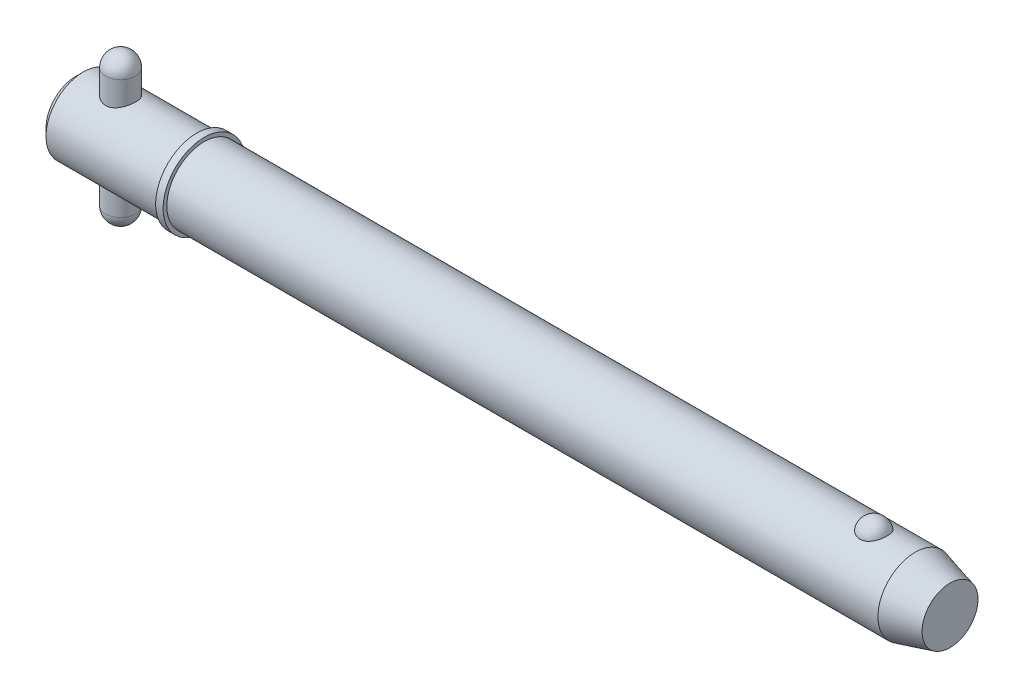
ISO-10303-21;
HEADER;
FILE_DESCRIPTION(('STEP AP214'),'2;1');
FILE_NAME('part.step','',(''),(''),'','','');
FILE_SCHEMA(('AUTOMOTIVE_DESIGN { 1 0 10303 214 1 1 1 1 }'));
ENDSEC;
DATA;
#1=APPLICATION_CONTEXT('core data for automotive mechanical design processes');
#2=APPLICATION_PROTOCOL_DEFINITION('international standard','automotive_design',2000,#1);
#3=PRODUCT_CONTEXT('',#1,'mechanical');
#4=PRODUCT('Part','Part','',(#3));
#5=PRODUCT_RELATED_PRODUCT_CATEGORY('part','',(#4));
#6=PRODUCT_DEFINITION_FORMATION('','',#4);
#7=PRODUCT_DEFINITION_CONTEXT('part definition',#1,'design');
#8=PRODUCT_DEFINITION('design','',#6,#7);
#9=PRODUCT_DEFINITION_SHAPE('','',#8);
#10=(LENGTH_UNIT() NAMED_UNIT(*) SI_UNIT(.MILLI.,.METRE.));
#11=(NAMED_UNIT(*) PLANE_ANGLE_UNIT() SI_UNIT($,.RADIAN.));
#12=(NAMED_UNIT(*) SI_UNIT($,.STERADIAN.) SOLID_ANGLE_UNIT());
#13=UNCERTAINTY_MEASURE_WITH_UNIT(LENGTH_MEASURE(1.E-05),#10,'distance_accuracy_value','');
#14=(GEOMETRIC_REPRESENTATION_CONTEXT(3) GLOBAL_UNCERTAINTY_ASSIGNED_CONTEXT((#13)) GLOBAL_UNIT_ASSIGNED_CONTEXT((#10,
#11,#12)) REPRESENTATION_CONTEXT('',''));
#15=CARTESIAN_POINT('',(0.,0.,0.));
#16=DIRECTION('',(0.,0.,1.));
#17=DIRECTION('',(1.,0.,0.));
#18=AXIS2_PLACEMENT_3D('',#15,#16,#17);
#19=CARTESIAN_POINT('',(9.525,15.875,0.));
#20=DIRECTION('',(0.,-1.,0.));
#21=DIRECTION('',(0.,0.,-1.));
#22=AXIS2_PLACEMENT_3D('',#19,#20,#21);
#23=CYLINDRICAL_SURFACE('',#22,3.175);
#24=CARTESIAN_POINT('',(9.525,-12.7,0.));
#25=DIRECTION('',(0.,-1.,0.));
#26=DIRECTION('',(0.,0.,-1.));
#27=AXIS2_PLACEMENT_3D('',#24,#25,#26);
#28=CIRCLE('',#27,3.175);
#29=CARTESIAN_POINT('',(9.525,-12.7,-3.175));
#30=VERTEX_POINT('',#29);
#31=EDGE_CURVE('P0_E10',#30,#30,#28,.F.);
#32=ORIENTED_EDGE('',*,*,#31,.T.);
#33=EDGE_LOOP('',(#32));
#34=FACE_BOUND('',#33,.T.);
#35=CARTESIAN_POINT('',(9.525,12.7,0.));
#36=DIRECTION('',(0.,-1.,0.));
#37=DIRECTION('',(0.,0.,-1.));
#38=AXIS2_PLACEMENT_3D('',#35,#36,#37);
#39=CIRCLE('',#38,3.175);
#40=CARTESIAN_POINT('',(9.525,12.7,-3.175));
#41=VERTEX_POINT('',#40);
#42=EDGE_CURVE('P0_E21',#41,#41,#39,.T.);
#43=ORIENTED_EDGE('',*,*,#42,.T.);
#44=EDGE_LOOP('',(#43));
#45=FACE_BOUND('',#44,.T.);
#46=ADVANCED_FACE('P0_F14',(#34,#45),#23,.T.);
#47=CARTESIAN_POINT('',(9.525,-12.7,0.));
#48=DIRECTION('',(0.,0.,1.));
#49=DIRECTION('',(1.,0.,0.));
#50=AXIS2_PLACEMENT_3D('',#47,#48,#49);
#51=SPHERICAL_SURFACE('',#50,3.175);
#52=CARTESIAN_POINT('',(9.525,-12.7,0.));
#53=DIRECTION('',(0.,-1.,0.));
#54=DIRECTION('',(0.,0.,-1.));
#55=AXIS2_PLACEMENT_3D('',#52,#53,#54);
#56=SPHERICAL_SURFACE('',#55,3.175);
#57=ORIENTED_EDGE('',*,*,#31,.F.);
#58=EDGE_LOOP('',(#57));
#59=FACE_BOUND('',#58,.T.);
#60=ADVANCED_FACE('P0_F29',(#59),#56,.T.);
#61=CARTESIAN_POINT('',(9.525,12.7,0.));
#62=DIRECTION('',(0.,0.,1.));
#63=DIRECTION('',(1.,0.,0.));
#64=AXIS2_PLACEMENT_3D('',#61,#62,#63);
#65=SPHERICAL_SURFACE('',#64,3.175);
#66=CARTESIAN_POINT('',(9.525,12.7,0.));
#67=DIRECTION('',(0.,-1.,0.));
#68=DIRECTION('',(0.,0.,-1.));
#69=AXIS2_PLACEMENT_3D('',#66,#67,#68);
#70=SPHERICAL_SURFACE('',#69,3.175);
#71=ORIENTED_EDGE('',*,*,#42,.F.);
#72=EDGE_LOOP('',(#71));
#73=FACE_BOUND('',#72,.T.);
#74=ADVANCED_FACE('P0_F16',(#73),#70,.T.);
#75=CLOSED_SHELL('',(#46,#60,#74));
#76=MANIFOLD_SOLID_BREP('P0_B1',#75);
#77=CARTESIAN_POINT('',(0.,0.,0.));
#78=DIRECTION('',(1.,0.,0.));
#79=DIRECTION('',(0.,0.,-1.));
#80=AXIS2_PLACEMENT_3D('',#77,#78,#79);
#81=CYLINDRICAL_SURFACE('',#80,7.94);
#82=CARTESIAN_POINT('',(178.651879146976,0.,0.));
#83=DIRECTION('',(1.,0.,0.));
#84=DIRECTION('',(0.,0.,-1.));
#85=AXIS2_PLACEMENT_3D('',#82,#83,#84);
#86=CIRCLE('',#85,7.94);
#87=CARTESIAN_POINT('',(178.651879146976,0.,-7.94));
#88=VERTEX_POINT('',#87);
#89=EDGE_CURVE('P1_E81',#88,#88,#86,.T.);
#90=ORIENTED_EDGE('',*,*,#89,.F.);
#91=EDGE_LOOP('',(#90));
#92=FACE_BOUND('',#91,.T.);
#93=CARTESIAN_POINT('',(27.31,0.,0.));
#94=DIRECTION('',(1.,0.,0.));
#95=DIRECTION('',(0.,0.,-1.));
#96=AXIS2_PLACEMENT_3D('',#93,#94,#95);
#97=CIRCLE('',#96,7.94);
#98=CARTESIAN_POINT('',(27.31,0.,-7.94));
#99=VERTEX_POINT('',#98);
#100=EDGE_CURVE('P1_E85',#99,#99,#97,.T.);
#101=ORIENTED_EDGE('',*,*,#100,.T.);
#102=EDGE_LOOP('',(#101));
#103=FACE_BOUND('',#102,.T.);
#104=CARTESIAN_POINT('',(169.844907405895,7.37767842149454,2.93486986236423));
#105=CARTESIAN_POINT('',(169.692749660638,7.3776732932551,2.93487505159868));
#106=CARTESIAN_POINT('',(169.540632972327,7.38258419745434,2.92262454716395));
#107=CARTESIAN_POINT('',(169.240928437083,7.40163229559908,2.87404196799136));
#108=CARTESIAN_POINT('',(169.093339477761,7.41576720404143,2.83771585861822));
#109=CARTESIAN_POINT('',(168.807018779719,7.45161576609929,2.74218769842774));
#110=CARTESIAN_POINT('',(168.668274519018,7.47331841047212,2.68301886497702));
#111=CARTESIAN_POINT('',(168.402882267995,7.52194082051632,2.54350967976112));
#112=CARTESIAN_POINT('',(168.276236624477,7.54886159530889,2.46316523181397));
#113=CARTESIAN_POINT('',(168.034534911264,7.60594671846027,2.28090375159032));
#114=CARTESIAN_POINT('',(167.919906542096,7.63618114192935,2.1784421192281));
#115=CARTESIAN_POINT('',(167.708878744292,7.69614046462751,1.95608495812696));
#116=CARTESIAN_POINT('',(167.612482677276,7.72586526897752,1.83618622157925));
#117=CARTESIAN_POINT('',(167.435938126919,7.78314821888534,1.57628086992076));
#118=CARTESIAN_POINT('',(167.356707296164,7.81055035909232,1.43561546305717));
#119=CARTESIAN_POINT('',(167.221797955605,7.85879631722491,1.14236334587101));
#120=CARTESIAN_POINT('',(167.166121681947,7.87963951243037,0.989775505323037));
#121=CARTESIAN_POINT('',(167.07881215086,7.91289645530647,0.674619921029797));
#122=CARTESIAN_POINT('',(167.04753090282,7.92518652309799,0.511941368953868));
#123=CARTESIAN_POINT('',(167.010975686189,7.93958930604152,0.183247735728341));
#124=CARTESIAN_POINT('',(167.005701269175,7.94170219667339,0.0172327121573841));
#125=CARTESIAN_POINT('',(167.021231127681,7.93554931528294,-0.312672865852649));
#126=CARTESIAN_POINT('',(167.041925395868,7.92732732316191,-0.476569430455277));
#127=CARTESIAN_POINT('',(167.10878655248,7.90141534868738,-0.79830524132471));
#128=CARTESIAN_POINT('',(167.154953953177,7.88372517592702,-0.956144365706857));
#129=CARTESIAN_POINT('',(167.271898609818,7.84066230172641,-1.26152073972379));
#130=CARTESIAN_POINT('',(167.342704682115,7.81528060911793,-1.40904568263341));
#131=CARTESIAN_POINT('',(167.507478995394,7.75948672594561,-1.68950598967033));
#132=CARTESIAN_POINT('',(167.601448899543,7.72907417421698,-1.82244030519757));
#133=CARTESIAN_POINT('',(167.810839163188,7.66640424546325,-2.07032792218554));
#134=CARTESIAN_POINT('',(167.926315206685,7.63414223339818,-2.18523308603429));
#135=CARTESIAN_POINT('',(168.1759006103,7.57149681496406,-2.39329737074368));
#136=CARTESIAN_POINT('',(168.310008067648,7.54111321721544,-2.48645870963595));
#137=CARTESIAN_POINT('',(168.590111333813,7.48650742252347,-2.64628132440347));
#138=CARTESIAN_POINT('',(168.735760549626,7.46215900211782,-2.71350554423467));
#139=CARTESIAN_POINT('',(169.037425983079,7.42171253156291,-2.82226614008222));
#140=CARTESIAN_POINT('',(169.193438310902,7.40561140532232,-2.86381209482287));
#141=CARTESIAN_POINT('',(169.502970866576,7.3842679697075,-2.9183907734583));
#142=CARTESIAN_POINT('',(169.656222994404,7.37852109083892,-2.93275024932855));
#143=CARTESIAN_POINT('',(169.963070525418,7.37700973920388,-2.93655208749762));
#144=CARTESIAN_POINT('',(170.116665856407,7.38124333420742,-2.92599927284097));
#145=CARTESIAN_POINT('',(170.414990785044,7.39890635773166,-2.88102897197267));
#146=CARTESIAN_POINT('',(170.559848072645,7.41205491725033,-2.84733999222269));
#147=CARTESIAN_POINT('',(170.84164329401,7.445801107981,-2.75788206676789));
#148=CARTESIAN_POINT('',(170.978580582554,7.46639934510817,-2.70211132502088));
#149=CARTESIAN_POINT('',(171.244061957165,7.51339098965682,-2.56858908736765));
#150=CARTESIAN_POINT('',(171.372354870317,7.53990200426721,-2.4903806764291));
#151=CARTESIAN_POINT('',(171.614244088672,7.59569503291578,-2.31462737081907));
#152=CARTESIAN_POINT('',(171.727837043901,7.6249776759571,-2.21707808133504));
#153=CARTESIAN_POINT('',(171.94322156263,7.68489473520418,-1.99982049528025));
#154=CARTESIAN_POINT('',(172.044148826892,7.71552419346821,-1.87925337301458));
#155=CARTESIAN_POINT('',(172.225186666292,7.77353016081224,-1.6226882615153));
#156=CARTESIAN_POINT('',(172.305293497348,7.80090608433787,-1.48668750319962));
#157=CARTESIAN_POINT('',(172.445361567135,7.85047992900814,-1.1981841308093));
#158=CARTESIAN_POINT('',(172.504587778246,7.87248183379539,-1.04529016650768));
#159=CARTESIAN_POINT('',(172.597982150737,7.90785114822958,-0.731080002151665));
#160=CARTESIAN_POINT('',(172.632149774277,7.92121837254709,-0.569763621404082));
#161=CARTESIAN_POINT('',(172.674795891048,7.93797834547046,-0.242812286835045));
#162=CARTESIAN_POINT('',(172.683204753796,7.94134405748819,-0.0771668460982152));
#163=CARTESIAN_POINT('',(172.673962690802,7.93767937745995,0.253276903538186));
#164=CARTESIAN_POINT('',(172.656312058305,7.93064910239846,0.418075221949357));
#165=CARTESIAN_POINT('',(172.595424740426,7.90695571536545,0.741525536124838));
#166=CARTESIAN_POINT('',(172.552281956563,7.8903279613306,0.900197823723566));
#167=CARTESIAN_POINT('',(172.44135358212,7.84916386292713,1.20759654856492));
#168=CARTESIAN_POINT('',(172.37356656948,7.82462706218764,1.35632241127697));
#169=CARTESIAN_POINT('',(172.214371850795,7.77006699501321,1.64032869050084));
#170=CARTESIAN_POINT('',(172.122861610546,7.74002008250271,1.7755471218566));
#171=CARTESIAN_POINT('',(171.918296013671,7.67774175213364,2.0280064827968));
#172=CARTESIAN_POINT('',(171.805241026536,7.64551037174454,2.14524772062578));
#173=CARTESIAN_POINT('',(171.560831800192,7.58265895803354,2.35778002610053));
#174=CARTESIAN_POINT('',(171.429583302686,7.5520309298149,2.45319004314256));
#175=CARTESIAN_POINT('',(171.151601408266,7.49579792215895,2.61999897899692));
#176=CARTESIAN_POINT('',(171.004867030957,7.4701932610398,2.69139637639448));
#177=CARTESIAN_POINT('',(170.692947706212,7.42622216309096,2.8105324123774));
#178=CARTESIAN_POINT('',(170.527220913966,7.40825002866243,2.85700910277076));
#179=CARTESIAN_POINT('',(170.189279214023,7.38398348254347,2.9191685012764));
#180=CARTESIAN_POINT('',(170.01706702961,7.3776842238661,2.93486399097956));
#181=CARTESIAN_POINT('',(169.844907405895,7.37767842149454,2.93486986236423));
#182=B_SPLINE_CURVE_WITH_KNOTS('',3,(#104,#105,#106,#107,#108,#109,#110,#111,#112,#113,#114,
#115,#116,#117,#118,#119,#120,#121,#122,#123,#124,#125,#126,#127,#128,#129,#130,#131,#132,#133,
#134,#135,#136,#137,#138,#139,#140,#141,#142,#143,#144,#145,#146,#147,#148,#149,#150,#151,#152,
#153,#154,#155,#156,#157,#158,#159,#160,#161,#162,#163,#164,#165,#166,#167,#168,#169,#170,#171,
#172,#173,#174,#175,#176,#177,#178,#179,#180,#181),.UNSPECIFIED.,.T.,.F.,(4,2,2,2,2,2,2,2,2,2,2,
2,2,2,2,2,2,2,2,2,2,2,2,2,2,2,2,2,2,2,2,2,2,2,2,2,2,2,4),(0.,0.455841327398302,
0.911569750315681,1.36663794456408,1.82179423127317,2.2897898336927,2.75787163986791,
3.24685368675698,3.73588214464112,4.23184282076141,4.72779494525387,5.22165321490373,
5.71552141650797,6.2099691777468,6.7044524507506,7.20023431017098,7.69596557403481,
8.18023418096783,8.66432203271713,9.12410697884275,9.58380291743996,10.0296503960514,
10.4755341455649,10.9312349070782,11.3870393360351,11.8654416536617,12.3439299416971,
12.8378875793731,13.3318558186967,13.8271581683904,14.3224549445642,14.8159385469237,
15.3094506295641,15.8051323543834,16.3008055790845,16.7937101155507,17.2866458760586,
17.8026240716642,18.3183879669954),.UNSPECIFIED.);
#183=CARTESIAN_POINT('',(169.844907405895,7.37767842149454,2.93486986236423));
#184=VERTEX_POINT('',#183);
#185=EDGE_CURVE('P1_E35',#184,#184,#182,.T.);
#186=ORIENTED_EDGE('',*,*,#185,.T.);
#187=EDGE_LOOP('',(#186));
#188=FACE_BOUND('',#187,.T.);
#189=ADVANCED_FACE('P1_F13',(#92,#103,#188),#81,.T.);
#190=CARTESIAN_POINT('',(0.,0.,0.));
#191=DIRECTION('',(-1.,0.,0.));
#192=DIRECTION('',(0.,0.,1.));
#193=AXIS2_PLACEMENT_3D('',#190,#191,#192);
#194=PLANE('',#193);
#195=CARTESIAN_POINT('',(0.,0.,0.));
#196=DIRECTION('',(1.,0.,0.));
#197=DIRECTION('',(0.,0.,-1.));
#198=AXIS2_PLACEMENT_3D('',#195,#196,#197);
#199=CIRCLE('',#198,6.352);
#200=CARTESIAN_POINT('',(0.,0.,-6.352));
#201=VERTEX_POINT('',#200);
#202=EDGE_CURVE('P1_E9',#201,#201,#199,.T.);
#203=ORIENTED_EDGE('',*,*,#202,.F.);
#204=EDGE_LOOP('',(#203));
#205=FACE_BOUND('',#204,.T.);
#206=ADVANCED_FACE('P1_F15',(#205),#194,.T.);
#207=CARTESIAN_POINT('',(1.58799999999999,0.,0.));
#208=DIRECTION('',(1.,0.,0.));
#209=DIRECTION('',(0.,0.,-1.));
#210=AXIS2_PLACEMENT_3D('',#207,#208,#209);
#211=CONICAL_SURFACE('',#210,7.94,0.78539816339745);
#212=ORIENTED_EDGE('',*,*,#202,.T.);
#213=EDGE_LOOP('',(#212));
#214=FACE_BOUND('',#213,.T.);
#215=CARTESIAN_POINT('',(1.58799999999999,0.,0.));
#216=DIRECTION('',(1.,0.,0.));
#217=DIRECTION('',(0.,0.,-1.));
#218=AXIS2_PLACEMENT_3D('',#215,#216,#217);
#219=CIRCLE('',#218,7.94);
#220=CARTESIAN_POINT('',(1.58799999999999,0.,-7.94));
#221=VERTEX_POINT('',#220);
#222=EDGE_CURVE('P1_E26',#221,#221,#219,.T.);
#223=ORIENTED_EDGE('',*,*,#222,.F.);
#224=EDGE_LOOP('',(#223));
#225=FACE_BOUND('',#224,.T.);
#226=ADVANCED_FACE('P1_F77',(#214,#225),#211,.T.);
#227=CARTESIAN_POINT('',(0.,0.,0.));
#228=DIRECTION('',(1.,0.,0.));
#229=DIRECTION('',(0.,0.,-1.));
#230=AXIS2_PLACEMENT_3D('',#227,#228,#229);
#231=CYLINDRICAL_SURFACE('',#230,7.94);
#232=CARTESIAN_POINT('',(9.525,-7.27756655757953,3.175));
#233=CARTESIAN_POINT('',(9.43992346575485,-7.27756715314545,3.17499935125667));
#234=CARTESIAN_POINT('',(9.35481882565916,-7.27906496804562,3.1715736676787));
#235=CARTESIAN_POINT('',(9.18524505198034,-7.28499816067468,3.15791803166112));
#236=CARTESIAN_POINT('',(9.100776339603,-7.28943533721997,3.14768391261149));
#237=CARTESIAN_POINT('',(8.84895715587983,-7.30698881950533,3.10684226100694));
#238=CARTESIAN_POINT('',(8.6834173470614,-7.32434654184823,3.06609574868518));
#239=CARTESIAN_POINT('',(8.36278910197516,-7.36806950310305,2.95945910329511));
#240=CARTESIAN_POINT('',(8.20766386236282,-7.39440078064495,2.89366366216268));
#241=CARTESIAN_POINT('',(7.91065319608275,-7.45304562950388,2.73907413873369));
#242=CARTESIAN_POINT('',(7.76876488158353,-7.48535789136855,2.65028508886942));
#243=CARTESIAN_POINT('',(7.49411086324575,-7.55439482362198,2.44679888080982));
#244=CARTESIAN_POINT('',(7.36219910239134,-7.59126138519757,2.33099745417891));
#245=CARTESIAN_POINT('',(7.11904234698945,-7.66408045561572,2.07909838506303));
#246=CARTESIAN_POINT('',(7.00780457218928,-7.70003264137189,1.94299368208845));
#247=CARTESIAN_POINT('',(6.80492173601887,-7.76867514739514,1.64775981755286));
#248=CARTESIAN_POINT('',(6.71422139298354,-7.80118112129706,1.48793473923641));
#249=CARTESIAN_POINT('',(6.56135788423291,-7.85754918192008,1.15376269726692));
#250=CARTESIAN_POINT('',(6.49918311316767,-7.88141478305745,0.979421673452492));
#251=CARTESIAN_POINT('',(6.40818142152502,-7.91680873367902,0.630115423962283));
#252=CARTESIAN_POINT('',(6.3778864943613,-7.9288781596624,0.455588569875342));
#253=CARTESIAN_POINT('',(6.34677743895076,-7.94127547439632,0.103539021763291));
#254=CARTESIAN_POINT('',(6.34595232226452,-7.94160773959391,-0.0739825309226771));
#255=CARTESIAN_POINT('',(6.37300128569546,-7.93082261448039,-0.416371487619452));
#256=CARTESIAN_POINT('',(6.39926693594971,-7.92034690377,-0.581389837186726));
#257=CARTESIAN_POINT('',(6.47701615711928,-7.88998770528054,-0.904449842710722));
#258=CARTESIAN_POINT('',(6.52850157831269,-7.87010352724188,-1.06249098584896));
#259=CARTESIAN_POINT('',(6.65586120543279,-7.82249343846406,-1.36995769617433));
#260=CARTESIAN_POINT('',(6.73209124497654,-7.79465387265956,-1.51921754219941));
#261=CARTESIAN_POINT('',(6.90644286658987,-7.73389606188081,-1.80321183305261));
#262=CARTESIAN_POINT('',(7.00457194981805,-7.70097607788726,-1.93794127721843));
#263=CARTESIAN_POINT('',(7.22744086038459,-7.63084889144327,-2.19843606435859));
#264=CARTESIAN_POINT('',(7.35350432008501,-7.59350211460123,-2.3230330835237));
#265=CARTESIAN_POINT('',(7.62488266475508,-7.52039654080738,-2.54979642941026));
#266=CARTESIAN_POINT('',(7.77020381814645,-7.48463826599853,-2.65195542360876));
#267=CARTESIAN_POINT('',(8.08119298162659,-7.41780943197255,-2.83361305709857));
#268=CARTESIAN_POINT('',(8.24731937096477,-7.38689959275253,-2.91239105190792));
#269=CARTESIAN_POINT('',(8.59204539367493,-7.33515216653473,-3.04038913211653));
#270=CARTESIAN_POINT('',(8.77063684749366,-7.31430804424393,-3.08962840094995));
#271=CARTESIAN_POINT('',(9.12356982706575,-7.28663831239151,-3.15431018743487));
#272=CARTESIAN_POINT('',(9.29750494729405,-7.2790344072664,-3.17163284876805));
#273=CARTESIAN_POINT('',(9.64592502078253,-7.27648884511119,-3.17747282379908));
#274=CARTESIAN_POINT('',(9.82040979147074,-7.28154335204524,-3.16599886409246));
#275=CARTESIAN_POINT('',(10.1545374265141,-7.30294638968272,-3.11628310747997));
#276=CARTESIAN_POINT('',(10.3144598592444,-7.31863587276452,-3.0796016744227));
#277=CARTESIAN_POINT('',(10.625774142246,-7.35872371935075,-2.98253618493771));
#278=CARTESIAN_POINT('',(10.7771640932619,-7.38312401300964,-2.92214687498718));
#279=CARTESIAN_POINT('',(11.0739599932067,-7.4390944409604,-2.77664664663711));
#280=CARTESIAN_POINT('',(11.2188745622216,-7.47091513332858,-2.69063278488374));
#281=CARTESIAN_POINT('',(11.4928722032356,-7.53775867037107,-2.49724834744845));
#282=CARTESIAN_POINT('',(11.6219487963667,-7.57278281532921,-2.38986907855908));
#283=CARTESIAN_POINT('',(11.8705091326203,-7.64520845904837,-2.1474449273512));
#284=CARTESIAN_POINT('',(11.9885816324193,-7.68259462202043,-2.01094304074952));
#285=CARTESIAN_POINT('',(12.2003631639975,-7.75309951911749,-1.71917041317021));
#286=CARTESIAN_POINT('',(12.2940712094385,-7.78621808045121,-1.56389891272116));
#287=CARTESIAN_POINT('',(12.4541161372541,-7.84456050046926,-1.23845027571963));
#288=CARTESIAN_POINT('',(12.5204600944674,-7.86978639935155,-1.06827700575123));
#289=CARTESIAN_POINT('',(12.6231407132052,-7.90943635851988,-0.717928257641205));
#290=CARTESIAN_POINT('',(12.6594936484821,-7.92386627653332,-0.537758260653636));
#291=CARTESIAN_POINT('',(12.6992281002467,-7.93967263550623,-0.185201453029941));
#292=CARTESIAN_POINT('',(12.7046050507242,-7.94183891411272,-0.0130732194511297));
#293=CARTESIAN_POINT('',(12.6875036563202,-7.9350072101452,0.329549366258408));
#294=CARTESIAN_POINT('',(12.6650295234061,-7.92601091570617,0.500043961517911));
#295=CARTESIAN_POINT('',(12.5942896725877,-7.89825976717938,0.829196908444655));
#296=CARTESIAN_POINT('',(12.5468364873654,-7.87981280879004,0.988057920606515));
#297=CARTESIAN_POINT('',(12.4283390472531,-7.83513565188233,1.29553461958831));
#298=CARTESIAN_POINT('',(12.3572904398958,-7.8089040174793,1.44414841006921));
#299=CARTESIAN_POINT('',(12.1900822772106,-7.7497911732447,1.73412879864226));
#300=CARTESIAN_POINT('',(12.0929519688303,-7.71666737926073,1.87488510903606));
#301=CARTESIAN_POINT('',(11.8777894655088,-7.64775894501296,2.13869231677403));
#302=CARTESIAN_POINT('',(11.7597486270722,-7.61197320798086,2.26173585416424));
#303=CARTESIAN_POINT('',(11.4974896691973,-7.53902341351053,2.49449755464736));
#304=CARTESIAN_POINT('',(11.3521039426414,-7.50191102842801,2.60292060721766));
#305=CARTESIAN_POINT('',(11.0440201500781,-7.43289551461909,2.79392602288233));
#306=CARTESIAN_POINT('',(10.8813200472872,-7.40099299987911,2.87650534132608));
#307=CARTESIAN_POINT('',(10.558064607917,-7.3489506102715,3.00682739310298));
#308=CARTESIAN_POINT('',(10.398627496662,-7.32801197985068,3.05703164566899));
#309=CARTESIAN_POINT('',(10.0731242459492,-7.29639491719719,3.13175843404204));
#310=CARTESIAN_POINT('',(9.90707793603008,-7.28568789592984,3.15635254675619));
#311=CARTESIAN_POINT('',(9.70441566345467,-7.27968826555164,3.17013149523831));
#312=CARTESIAN_POINT('',(9.66856669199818,-7.27889378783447,3.17195593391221));
#313=CARTESIAN_POINT('',(9.59681348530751,-7.27783278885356,3.17439036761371));
#314=CARTESIAN_POINT('',(9.56090924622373,-7.27756630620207,3.17500027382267));
#315=CARTESIAN_POINT('',(9.525,-7.27756655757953,3.175));
#316=B_SPLINE_CURVE_WITH_KNOTS('',3,(#232,#233,#234,#235,#236,#237,#238,#239,#240,#241,#242,
#243,#244,#245,#246,#247,#248,#249,#250,#251,#252,#253,#254,#255,#256,#257,#258,#259,#260,#261,
#262,#263,#264,#265,#266,#267,#268,#269,#270,#271,#272,#273,#274,#275,#276,#277,#278,#279,#280,
#281,#282,#283,#284,#285,#286,#287,#288,#289,#290,#291,#292,#293,#294,#295,#296,#297,#298,#299,
#300,#301,#302,#303,#304,#305,#306,#307,#308,#309,#310,#311,#312,#313,#314,#315),.UNSPECIFIED.,
.T.,.F.,(4,2,2,2,2,2,2,2,2,2,2,2,2,2,2,2,2,2,2,2,2,2,2,2,2,2,2,2,2,2,2,2,2,2,2,2,2,2,2,2,2,4),
(0.,0.255187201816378,0.510530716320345,1.0218798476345,1.53131482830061,2.04063840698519,
2.57635929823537,3.11226692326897,3.66929090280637,4.22608806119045,4.75594400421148,
5.28560237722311,5.78552836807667,6.28549104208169,6.79298787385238,7.30065880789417,
7.8416422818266,8.38280228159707,8.93923025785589,9.49529647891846,10.0174074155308,
10.5393601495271,11.0316114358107,11.5239718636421,12.0362920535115,12.5488211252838,
13.0991799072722,13.6495609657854,14.1997996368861,14.7497395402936,15.2638187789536,
15.7778202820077,16.2760504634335,16.7743726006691,17.294711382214,17.8152657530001,
18.3680208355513,18.9208410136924,19.4240423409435,19.9258334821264,20.0335354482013,
20.1412452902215),.UNSPECIFIED.);
#317=CARTESIAN_POINT('',(9.525,-7.27756655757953,3.175));
#318=VERTEX_POINT('',#317);
#319=EDGE_CURVE('P1_E17',#318,#318,#316,.T.);
#320=ORIENTED_EDGE('',*,*,#319,.F.);
#321=EDGE_LOOP('',(#320));
#322=FACE_BOUND('',#321,.T.);
#323=CARTESIAN_POINT('',(9.525,7.27756655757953,3.175));
#324=CARTESIAN_POINT('',(9.61007653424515,7.27756715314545,3.17499935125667));
#325=CARTESIAN_POINT('',(9.69518117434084,7.27906496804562,3.1715736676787));
#326=CARTESIAN_POINT('',(9.86475494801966,7.28499816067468,3.15791803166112));
#327=CARTESIAN_POINT('',(9.949223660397,7.28943533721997,3.14768391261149));
#328=CARTESIAN_POINT('',(10.2010428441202,7.30698881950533,3.10684226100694));
#329=CARTESIAN_POINT('',(10.3665826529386,7.32434654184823,3.06609574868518));
#330=CARTESIAN_POINT('',(10.6872108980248,7.36806950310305,2.95945910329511));
#331=CARTESIAN_POINT('',(10.8423361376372,7.39440078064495,2.89366366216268));
#332=CARTESIAN_POINT('',(11.1393468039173,7.45304562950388,2.73907413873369));
#333=CARTESIAN_POINT('',(11.2812351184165,7.48535789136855,2.65028508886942));
#334=CARTESIAN_POINT('',(11.5558891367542,7.55439482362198,2.44679888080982));
#335=CARTESIAN_POINT('',(11.6878008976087,7.59126138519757,2.33099745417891));
#336=CARTESIAN_POINT('',(11.9309576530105,7.66408045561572,2.07909838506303));
#337=CARTESIAN_POINT('',(12.0421954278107,7.70003264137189,1.94299368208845));
#338=CARTESIAN_POINT('',(12.2450782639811,7.76867514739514,1.64775981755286));
#339=CARTESIAN_POINT('',(12.3357786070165,7.80118112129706,1.48793473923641));
#340=CARTESIAN_POINT('',(12.4886421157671,7.85754918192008,1.15376269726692));
#341=CARTESIAN_POINT('',(12.5508168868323,7.88141478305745,0.979421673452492));
#342=CARTESIAN_POINT('',(12.641818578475,7.91680873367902,0.630115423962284));
#343=CARTESIAN_POINT('',(12.6721135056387,7.9288781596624,0.455588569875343));
#344=CARTESIAN_POINT('',(12.7032225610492,7.94127547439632,0.103539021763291));
#345=CARTESIAN_POINT('',(12.7040476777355,7.94160773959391,-0.0739825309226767));
#346=CARTESIAN_POINT('',(12.6769987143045,7.93082261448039,-0.416371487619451));
#347=CARTESIAN_POINT('',(12.6507330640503,7.92034690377,-0.581389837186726));
#348=CARTESIAN_POINT('',(12.5729838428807,7.88998770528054,-0.904449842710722));
#349=CARTESIAN_POINT('',(12.5214984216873,7.87010352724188,-1.06249098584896));
#350=CARTESIAN_POINT('',(12.3941387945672,7.82249343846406,-1.36995769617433));
#351=CARTESIAN_POINT('',(12.3179087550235,7.79465387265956,-1.51921754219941));
#352=CARTESIAN_POINT('',(12.1435571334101,7.73389606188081,-1.80321183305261));
#353=CARTESIAN_POINT('',(12.0454280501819,7.70097607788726,-1.93794127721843));
#354=CARTESIAN_POINT('',(11.8225591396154,7.63084889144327,-2.19843606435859));
#355=CARTESIAN_POINT('',(11.696495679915,7.59350211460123,-2.3230330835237));
#356=CARTESIAN_POINT('',(11.4251173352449,7.52039654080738,-2.54979642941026));
#357=CARTESIAN_POINT('',(11.2797961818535,7.48463826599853,-2.65195542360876));
#358=CARTESIAN_POINT('',(10.9688070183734,7.41780943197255,-2.83361305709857));
#359=CARTESIAN_POINT('',(10.8026806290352,7.38689959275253,-2.91239105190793));
#360=CARTESIAN_POINT('',(10.4579546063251,7.33515216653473,-3.04038913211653));
#361=CARTESIAN_POINT('',(10.2793631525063,7.31430804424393,-3.08962840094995));
#362=CARTESIAN_POINT('',(9.92643017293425,7.28663831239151,-3.15431018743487));
#363=CARTESIAN_POINT('',(9.75249505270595,7.2790344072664,-3.17163284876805));
#364=CARTESIAN_POINT('',(9.40407497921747,7.2764888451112,-3.17747282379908));
#365=CARTESIAN_POINT('',(9.22959020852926,7.28154335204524,-3.16599886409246));
#366=CARTESIAN_POINT('',(8.89546257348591,7.30294638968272,-3.11628310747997));
#367=CARTESIAN_POINT('',(8.73554014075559,7.31863587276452,-3.0796016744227));
#368=CARTESIAN_POINT('',(8.42422585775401,7.35872371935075,-2.98253618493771));
#369=CARTESIAN_POINT('',(8.27283590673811,7.38312401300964,-2.92214687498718));
#370=CARTESIAN_POINT('',(7.97604000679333,7.4390944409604,-2.77664664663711));
#371=CARTESIAN_POINT('',(7.83112543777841,7.47091513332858,-2.69063278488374));
#372=CARTESIAN_POINT('',(7.55712779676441,7.53775867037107,-2.49724834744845));
#373=CARTESIAN_POINT('',(7.42805120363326,7.57278281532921,-2.38986907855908));
#374=CARTESIAN_POINT('',(7.17949086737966,7.64520845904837,-2.1474449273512));
#375=CARTESIAN_POINT('',(7.06141836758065,7.68259462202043,-2.01094304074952));
#376=CARTESIAN_POINT('',(6.8496368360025,7.75309951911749,-1.71917041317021));
#377=CARTESIAN_POINT('',(6.75592879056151,7.78621808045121,-1.56389891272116));
#378=CARTESIAN_POINT('',(6.59588386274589,7.84456050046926,-1.23845027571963));
#379=CARTESIAN_POINT('',(6.52953990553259,7.86978639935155,-1.06827700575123));
#380=CARTESIAN_POINT('',(6.42685928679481,7.90943635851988,-0.717928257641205));
#381=CARTESIAN_POINT('',(6.39050635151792,7.92386627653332,-0.537758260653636));
#382=CARTESIAN_POINT('',(6.35077189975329,7.93967263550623,-0.18520145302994));
#383=CARTESIAN_POINT('',(6.34539494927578,7.94183891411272,-0.0130732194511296));
#384=CARTESIAN_POINT('',(6.36249634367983,7.9350072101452,0.329549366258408));
#385=CARTESIAN_POINT('',(6.38497047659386,7.92601091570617,0.500043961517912));
#386=CARTESIAN_POINT('',(6.45571032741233,7.89825976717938,0.829196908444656));
#387=CARTESIAN_POINT('',(6.50316351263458,7.87981280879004,0.988057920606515));
#388=CARTESIAN_POINT('',(6.62166095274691,7.83513565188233,1.29553461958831));
#389=CARTESIAN_POINT('',(6.69270956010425,7.8089040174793,1.44414841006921));
#390=CARTESIAN_POINT('',(6.85991772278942,7.7497911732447,1.73412879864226));
#391=CARTESIAN_POINT('',(6.95704803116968,7.71666737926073,1.87488510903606));
#392=CARTESIAN_POINT('',(7.17221053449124,7.64775894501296,2.13869231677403));
#393=CARTESIAN_POINT('',(7.29025137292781,7.61197320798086,2.26173585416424));
#394=CARTESIAN_POINT('',(7.55251033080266,7.53902341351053,2.49449755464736));
#395=CARTESIAN_POINT('',(7.69789605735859,7.50191102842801,2.60292060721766));
#396=CARTESIAN_POINT('',(8.00597984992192,7.43289551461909,2.79392602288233));
#397=CARTESIAN_POINT('',(8.16867995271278,7.40099299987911,2.87650534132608));
#398=CARTESIAN_POINT('',(8.49193539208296,7.3489506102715,3.00682739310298));
#399=CARTESIAN_POINT('',(8.65137250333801,7.32801197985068,3.05703164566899));
#400=CARTESIAN_POINT('',(8.97687575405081,7.29639491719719,3.13175843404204));
#401=CARTESIAN_POINT('',(9.14292206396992,7.28568789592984,3.15635254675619));
#402=CARTESIAN_POINT('',(9.34558433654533,7.27968826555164,3.17013149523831));
#403=CARTESIAN_POINT('',(9.38143330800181,7.27889378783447,3.17195593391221));
#404=CARTESIAN_POINT('',(9.45318651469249,7.27783278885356,3.17439036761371));
#405=CARTESIAN_POINT('',(9.48909075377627,7.27756630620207,3.17500027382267));
#406=CARTESIAN_POINT('',(9.525,7.27756655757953,3.175));
#407=B_SPLINE_CURVE_WITH_KNOTS('',3,(#323,#324,#325,#326,#327,#328,#329,#330,#331,#332,#333,
#334,#335,#336,#337,#338,#339,#340,#341,#342,#343,#344,#345,#346,#347,#348,#349,#350,#351,#352,
#353,#354,#355,#356,#357,#358,#359,#360,#361,#362,#363,#364,#365,#366,#367,#368,#369,#370,#371,
#372,#373,#374,#375,#376,#377,#378,#379,#380,#381,#382,#383,#384,#385,#386,#387,#388,#389,#390,
#391,#392,#393,#394,#395,#396,#397,#398,#399,#400,#401,#402,#403,#404,#405,#406),.UNSPECIFIED.,
.T.,.F.,(4,2,2,2,2,2,2,2,2,2,2,2,2,2,2,2,2,2,2,2,2,2,2,2,2,2,2,2,2,2,2,2,2,2,2,2,2,2,2,2,2,4),
(0.,0.255187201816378,0.510530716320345,1.0218798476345,1.53131482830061,2.04063840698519,
2.57635929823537,3.11226692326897,3.66929090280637,4.22608806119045,4.75594400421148,
5.2856023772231,5.78552836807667,6.28549104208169,6.79298787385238,7.30065880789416,
7.8416422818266,8.38280228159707,8.9392302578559,9.49529647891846,10.0174074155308,
10.5393601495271,11.0316114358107,11.5239718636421,12.0362920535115,12.5488211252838,
13.0991799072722,13.6495609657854,14.1997996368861,14.7497395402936,15.2638187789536,
15.7778202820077,16.2760504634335,16.7743726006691,17.294711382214,17.8152657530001,
18.3680208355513,18.9208410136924,19.4240423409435,19.9258334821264,20.0335354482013,
20.1412452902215),.UNSPECIFIED.);
#408=CARTESIAN_POINT('',(9.525,7.27756655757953,3.175));
#409=VERTEX_POINT('',#408);
#410=EDGE_CURVE('P1_E43',#409,#409,#407,.T.);
#411=ORIENTED_EDGE('',*,*,#410,.F.);
#412=EDGE_LOOP('',(#411));
#413=FACE_BOUND('',#412,.T.);
#414=ORIENTED_EDGE('',*,*,#222,.T.);
#415=EDGE_LOOP('',(#414));
#416=FACE_BOUND('',#415,.T.);
#417=CARTESIAN_POINT('',(25.722,0.,0.));
#418=DIRECTION('',(1.,0.,0.));
#419=DIRECTION('',(0.,0.,-1.));
#420=AXIS2_PLACEMENT_3D('',#417,#418,#419);
#421=CIRCLE('',#420,7.94);
#422=CARTESIAN_POINT('',(25.722,0.,-7.94));
#423=VERTEX_POINT('',#422);
#424=EDGE_CURVE('P1_E31',#423,#423,#421,.T.);
#425=ORIENTED_EDGE('',*,*,#424,.F.);
#426=EDGE_LOOP('',(#425));
#427=FACE_BOUND('',#426,.T.);
#428=ADVANCED_FACE('P1_F103',(#322,#413,#416,#427),#231,.T.);
#429=CARTESIAN_POINT('',(25.722,7.94,0.));
#430=DIRECTION('',(-1.,0.,0.));
#431=DIRECTION('',(0.,0.,1.));
#432=AXIS2_PLACEMENT_3D('',#429,#430,#431);
#433=PLANE('',#432);
#434=ORIENTED_EDGE('',*,*,#424,.T.);
#435=EDGE_LOOP('',(#434));
#436=FACE_BOUND('',#435,.T.);
#437=CARTESIAN_POINT('',(25.722,0.,0.));
#438=DIRECTION('',(1.,0.,0.));
#439=DIRECTION('',(0.,0.,-1.));
#440=AXIS2_PLACEMENT_3D('',#437,#438,#439);
#441=CIRCLE('',#440,8.734);
#442=CARTESIAN_POINT('',(25.722,0.,-8.734));
#443=VERTEX_POINT('',#442);
#444=EDGE_CURVE('P1_E91',#443,#443,#441,.T.);
#445=ORIENTED_EDGE('',*,*,#444,.F.);
#446=EDGE_LOOP('',(#445));
#447=FACE_BOUND('',#446,.T.);
#448=ADVANCED_FACE('P1_F100',(#436,#447),#433,.T.);
#449=CARTESIAN_POINT('',(0.,0.,0.));
#450=DIRECTION('',(1.,0.,0.));
#451=DIRECTION('',(0.,0.,-1.));
#452=AXIS2_PLACEMENT_3D('',#449,#450,#451);
#453=CYLINDRICAL_SURFACE('',#452,8.734);
#454=ORIENTED_EDGE('',*,*,#444,.T.);
#455=EDGE_LOOP('',(#454));
#456=FACE_BOUND('',#455,.T.);
#457=CARTESIAN_POINT('',(27.31,0.,0.));
#458=DIRECTION('',(1.,0.,0.));
#459=DIRECTION('',(0.,0.,-1.));
#460=AXIS2_PLACEMENT_3D('',#457,#458,#459);
#461=CIRCLE('',#460,8.734);
#462=CARTESIAN_POINT('',(27.31,0.,-8.734));
#463=VERTEX_POINT('',#462);
#464=EDGE_CURVE('P1_E88',#463,#463,#461,.T.);
#465=ORIENTED_EDGE('',*,*,#464,.F.);
#466=EDGE_LOOP('',(#465));
#467=FACE_BOUND('',#466,.T.);
#468=ADVANCED_FACE('P1_F68',(#456,#467),#453,.T.);
#469=CARTESIAN_POINT('',(27.31,8.734,0.));
#470=DIRECTION('',(1.,0.,0.));
#471=DIRECTION('',(0.,0.,-1.));
#472=AXIS2_PLACEMENT_3D('',#469,#470,#471);
#473=PLANE('',#472);
#474=ORIENTED_EDGE('',*,*,#464,.T.);
#475=EDGE_LOOP('',(#474));
#476=FACE_BOUND('',#475,.T.);
#477=ORIENTED_EDGE('',*,*,#100,.F.);
#478=EDGE_LOOP('',(#477));
#479=FACE_BOUND('',#478,.T.);
#480=ADVANCED_FACE('P1_F62',(#476,#479),#473,.T.);
#481=CARTESIAN_POINT('',(186.06,0.,0.));
#482=DIRECTION('',(-1.,0.,0.));
#483=DIRECTION('',(0.,0.,1.));
#484=AXIS2_PLACEMENT_3D('',#481,#482,#483);
#485=CONICAL_SURFACE('',#484,5.95500000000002,0.26179938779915);
#486=ORIENTED_EDGE('',*,*,#89,.T.);
#487=EDGE_LOOP('',(#486));
#488=FACE_BOUND('',#487,.T.);
#489=CARTESIAN_POINT('',(186.06,0.,0.));
#490=DIRECTION('',(1.,0.,0.));
#491=DIRECTION('',(0.,0.,-1.));
#492=AXIS2_PLACEMENT_3D('',#489,#490,#491);
#493=CIRCLE('',#492,5.95500000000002);
#494=CARTESIAN_POINT('',(186.06,0.,-5.95500000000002));
#495=VERTEX_POINT('',#494);
#496=EDGE_CURVE('P1_E42',#495,#495,#493,.T.);
#497=ORIENTED_EDGE('',*,*,#496,.F.);
#498=EDGE_LOOP('',(#497));
#499=FACE_BOUND('',#498,.T.);
#500=ADVANCED_FACE('P1_F59',(#488,#499),#485,.T.);
#501=CARTESIAN_POINT('',(186.06,5.95500000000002,0.));
#502=DIRECTION('',(1.,0.,0.));
#503=DIRECTION('',(0.,0.,-1.));
#504=AXIS2_PLACEMENT_3D('',#501,#502,#503);
#505=PLANE('',#504);
#506=ORIENTED_EDGE('',*,*,#496,.T.);
#507=EDGE_LOOP('',(#506));
#508=FACE_BOUND('',#507,.T.);
#509=ADVANCED_FACE('P1_F55',(#508),#505,.T.);
#510=CARTESIAN_POINT('',(169.844907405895,7.146,0.));
#511=DIRECTION('',(-1.,0.,0.));
#512=DIRECTION('',(0.,1.,0.));
#513=AXIS2_PLACEMENT_3D('',#510,#511,#512);
#514=SPHERICAL_SURFACE('',#513,2.944);
#515=ORIENTED_EDGE('',*,*,#185,.F.);
#516=EDGE_LOOP('',(#515));
#517=FACE_BOUND('',#516,.T.);
#518=ADVANCED_FACE('P1_F50',(#517),#514,.T.);
#519=CARTESIAN_POINT('',(9.525,-8.734,0.));
#520=DIRECTION('',(0.,1.,0.));
#521=DIRECTION('',(0.,0.,1.));
#522=AXIS2_PLACEMENT_3D('',#519,#520,#521);
#523=CYLINDRICAL_SURFACE('',#522,3.175);
#524=ORIENTED_EDGE('',*,*,#319,.T.);
#525=EDGE_LOOP('',(#524));
#526=FACE_BOUND('',#525,.T.);
#527=ORIENTED_EDGE('',*,*,#410,.T.);
#528=EDGE_LOOP('',(#527));
#529=FACE_BOUND('',#528,.T.);
#530=ADVANCED_FACE('P1_F54',(#526,#529),#523,.F.);
#531=CLOSED_SHELL('',(#189,#206,#226,#428,#448,#468,#480,#500,#509,#518,#530));
#532=MANIFOLD_SOLID_BREP('P1_B1',#531);
#533=ADVANCED_BREP_SHAPE_REPRESENTATION('',(#18,#76,#532),#14);
#534=SHAPE_DEFINITION_REPRESENTATION(#9,#533);
ENDSEC;
END-ISO-10303-21;
